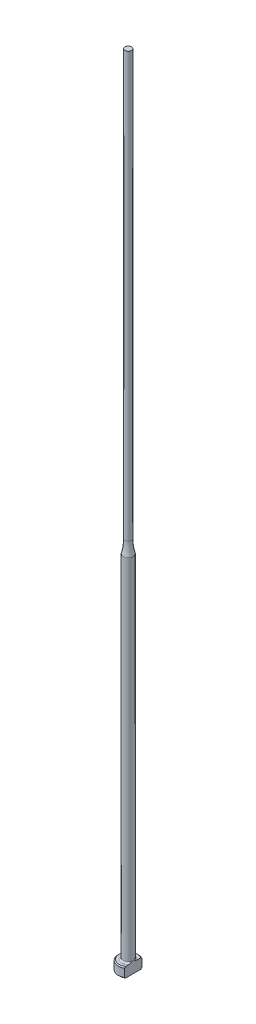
ISO-10303-21;
HEADER;
FILE_DESCRIPTION(('STEP AP214'),'2;1');
FILE_NAME('part.step','',(''),(''),'','','');
FILE_SCHEMA(('AUTOMOTIVE_DESIGN { 1 0 10303 214 1 1 1 1 }'));
ENDSEC;
DATA;
#1=APPLICATION_CONTEXT('core data for automotive mechanical design processes');
#2=APPLICATION_PROTOCOL_DEFINITION('international standard','automotive_design',2000,#1);
#3=PRODUCT_CONTEXT('',#1,'mechanical');
#4=PRODUCT('Part','Part','',(#3));
#5=PRODUCT_RELATED_PRODUCT_CATEGORY('part','',(#4));
#6=PRODUCT_DEFINITION_FORMATION('','',#4);
#7=PRODUCT_DEFINITION_CONTEXT('part definition',#1,'design');
#8=PRODUCT_DEFINITION('design','',#6,#7);
#9=PRODUCT_DEFINITION_SHAPE('','',#8);
#10=(LENGTH_UNIT() NAMED_UNIT(*) SI_UNIT(.MILLI.,.METRE.));
#11=(NAMED_UNIT(*) PLANE_ANGLE_UNIT() SI_UNIT($,.RADIAN.));
#12=(NAMED_UNIT(*) SI_UNIT($,.STERADIAN.) SOLID_ANGLE_UNIT());
#13=UNCERTAINTY_MEASURE_WITH_UNIT(LENGTH_MEASURE(1.E-05),#10,'distance_accuracy_value','');
#14=(GEOMETRIC_REPRESENTATION_CONTEXT(3) GLOBAL_UNCERTAINTY_ASSIGNED_CONTEXT((#13)) GLOBAL_UNIT_ASSIGNED_CONTEXT((#10,
#11,#12)) REPRESENTATION_CONTEXT('',''));
#15=CARTESIAN_POINT('',(0.,0.,0.));
#16=DIRECTION('',(0.,0.,1.));
#17=DIRECTION('',(1.,0.,0.));
#18=AXIS2_PLACEMENT_3D('',#15,#16,#17);
#19=CARTESIAN_POINT('',(-1.99999999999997,2.,0.));
#20=DIRECTION('',(0.,1.,0.));
#21=DIRECTION('',(0.,0.,1.));
#22=AXIS2_PLACEMENT_3D('',#19,#20,#21);
#23=PLANE('',#22);
#24=CARTESIAN_POINT('',(0.,2.,0.));
#25=DIRECTION('',(0.,1.,0.));
#26=DIRECTION('',(0.,0.,1.));
#27=AXIS2_PLACEMENT_3D('',#24,#25,#26);
#28=CIRCLE('',#27,1.79999999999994);
#29=CARTESIAN_POINT('',(0.999999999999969,2.,-1.49666295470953));
#30=VERTEX_POINT('',#29);
#31=CARTESIAN_POINT('',(0.999999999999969,2.,1.49666295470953));
#32=VERTEX_POINT('',#31);
#33=EDGE_CURVE('E187',#30,#32,#28,.T.);
#34=ORIENTED_EDGE('',*,*,#33,.T.);
#35=DIRECTION('',(0.,0.,-1.));
#36=VECTOR('',#35,1.);
#37=CARTESIAN_POINT('',(0.999999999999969,2.,0.));
#38=LINE('',#37,#36);
#39=CARTESIAN_POINT('',(0.999999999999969,2.00000000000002,0.830662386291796));
#40=VERTEX_POINT('',#39);
#41=EDGE_CURVE('E57',#32,#40,#38,.T.);
#42=ORIENTED_EDGE('',*,*,#41,.T.);
#43=CARTESIAN_POINT('',(0.,2.,0.));
#44=DIRECTION('',(0.,1.,0.));
#45=DIRECTION('',(0.,0.,1.));
#46=AXIS2_PLACEMENT_3D('',#43,#44,#45);
#47=CIRCLE('',#46,1.29999999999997);
#48=CARTESIAN_POINT('',(0.999999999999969,2.00000000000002,-0.830662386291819));
#49=VERTEX_POINT('',#48);
#50=EDGE_CURVE('E108',#40,#49,#47,.F.);
#51=ORIENTED_EDGE('',*,*,#50,.T.);
#52=EDGE_CURVE('E137',#49,#30,#38,.T.);
#53=ORIENTED_EDGE('',*,*,#52,.T.);
#54=EDGE_LOOP('',(#34,#42,#51,#53));
#55=FACE_BOUND('',#54,.T.);
#56=ADVANCED_FACE('F32',(#55),#23,.T.);
#57=CARTESIAN_POINT('',(0.,259.958771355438,0.));
#58=DIRECTION('',(0.,1.,0.));
#59=DIRECTION('',(0.,0.,1.));
#60=AXIS2_PLACEMENT_3D('',#57,#58,#59);
#61=CYLINDRICAL_SURFACE('',#60,1.99999999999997);
#62=CARTESIAN_POINT('',(0.,1.79999999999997,0.));
#63=DIRECTION('',(0.,1.,0.));
#64=DIRECTION('',(0.,0.,1.));
#65=AXIS2_PLACEMENT_3D('',#62,#63,#64);
#66=CIRCLE('',#65,1.99999999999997);
#67=CARTESIAN_POINT('',(0.999999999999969,1.79999999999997,1.73205080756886));
#68=VERTEX_POINT('',#67);
#69=CARTESIAN_POINT('',(0.999999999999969,1.79999999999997,-1.73205080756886));
#70=VERTEX_POINT('',#69);
#71=EDGE_CURVE('E105',#68,#70,#66,.F.);
#72=ORIENTED_EDGE('',*,*,#71,.T.);
#73=DIRECTION('',(0.,-1.,0.));
#74=VECTOR('',#73,1.);
#75=CARTESIAN_POINT('',(0.999999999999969,160.,-1.73205080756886));
#76=LINE('',#75,#74);
#77=CARTESIAN_POINT('',(0.999999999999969,0.199999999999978,-1.73205080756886));
#78=VERTEX_POINT('',#77);
#79=EDGE_CURVE('E193',#70,#78,#76,.T.);
#80=ORIENTED_EDGE('',*,*,#79,.T.);
#81=CARTESIAN_POINT('',(0.,0.199999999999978,0.));
#82=DIRECTION('',(0.,-1.,0.));
#83=DIRECTION('',(0.,0.,-1.));
#84=AXIS2_PLACEMENT_3D('',#81,#82,#83);
#85=CIRCLE('',#84,1.99999999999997);
#86=CARTESIAN_POINT('',(0.999999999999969,0.199999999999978,1.73205080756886));
#87=VERTEX_POINT('',#86);
#88=EDGE_CURVE('E100',#78,#87,#85,.F.);
#89=ORIENTED_EDGE('',*,*,#88,.T.);
#90=DIRECTION('',(0.,-1.,0.));
#91=VECTOR('',#90,1.);
#92=CARTESIAN_POINT('',(0.999999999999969,160.,1.73205080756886));
#93=LINE('',#92,#91);
#94=EDGE_CURVE('E93',#68,#87,#93,.T.);
#95=ORIENTED_EDGE('',*,*,#94,.F.);
#96=EDGE_LOOP('',(#72,#80,#89,#95));
#97=FACE_BOUND('',#96,.T.);
#98=ADVANCED_FACE('F158',(#97),#61,.T.);
#99=CARTESIAN_POINT('',(0.,0.,0.));
#100=DIRECTION('',(0.,-1.,0.));
#101=DIRECTION('',(0.,0.,-1.));
#102=AXIS2_PLACEMENT_3D('',#99,#100,#101);
#103=PLANE('',#102);
#104=CARTESIAN_POINT('',(0.,0.,0.));
#105=DIRECTION('',(0.,-1.,0.));
#106=DIRECTION('',(0.,0.,-1.));
#107=AXIS2_PLACEMENT_3D('',#104,#105,#106);
#108=CIRCLE('',#107,1.79999999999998);
#109=CARTESIAN_POINT('',(0.999999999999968,0.,1.49666295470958));
#110=VERTEX_POINT('',#109);
#111=CARTESIAN_POINT('',(0.999999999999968,0.,-1.49666295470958));
#112=VERTEX_POINT('',#111);
#113=EDGE_CURVE('E98',#110,#112,#108,.T.);
#114=ORIENTED_EDGE('',*,*,#113,.T.);
#115=DIRECTION('',(0.,0.,1.));
#116=VECTOR('',#115,1.);
#117=CARTESIAN_POINT('',(0.999999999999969,0.,-1.73205080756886));
#118=LINE('',#117,#116);
#119=EDGE_CURVE('E83',#112,#110,#118,.T.);
#120=ORIENTED_EDGE('',*,*,#119,.T.);
#121=EDGE_LOOP('',(#114,#120));
#122=FACE_BOUND('',#121,.T.);
#123=ADVANCED_FACE('F103',(#122),#103,.T.);
#124=CARTESIAN_POINT('',(0.,2.,0.));
#125=DIRECTION('',(0.,-1.,0.));
#126=DIRECTION('',(0.,0.,-1.));
#127=AXIS2_PLACEMENT_3D('',#124,#125,#126);
#128=CONICAL_SURFACE('',#127,1.79999999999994,0.785398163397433);
#129=ORIENTED_EDGE('',*,*,#71,.F.);
#130=CARTESIAN_POINT('',(0.999999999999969,-0.143084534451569,3.81417299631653));
#131=CARTESIAN_POINT('',(0.999999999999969,-0.0593997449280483,3.72765647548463));
#132=CARTESIAN_POINT('',(0.999999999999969,0.0241940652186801,3.64105173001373));
#133=CARTESIAN_POINT('',(0.999999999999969,0.191148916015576,3.46761616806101));
#134=CARTESIAN_POINT('',(0.999999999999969,0.274509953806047,3.3807853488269));
#135=CARTESIAN_POINT('',(0.999999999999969,0.524249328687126,3.11979400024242));
#136=CARTESIAN_POINT('',(0.999999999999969,0.690198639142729,2.94522254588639));
#137=CARTESIAN_POINT('',(0.999999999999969,1.01697550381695,2.59782670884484));
#138=CARTESIAN_POINT('',(0.999999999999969,1.17783928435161,2.42503661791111));
#139=CARTESIAN_POINT('',(0.999999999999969,1.41669118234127,2.16364984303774));
#140=CARTESIAN_POINT('',(0.999999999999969,1.49589273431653,2.07616357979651));
#141=CARTESIAN_POINT('',(0.999999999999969,1.65313803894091,1.90015721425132));
#142=CARTESIAN_POINT('',(0.999999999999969,1.73118183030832,1.81163714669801));
#143=CARTESIAN_POINT('',(0.999999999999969,1.85567318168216,1.66767927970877));
#144=CARTESIAN_POINT('',(0.999999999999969,1.90265415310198,1.61270332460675));
#145=CARTESIAN_POINT('',(0.999999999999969,1.99577882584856,1.50203557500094));
#146=CARTESIAN_POINT('',(0.999999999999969,2.04192244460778,1.44634371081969));
#147=CARTESIAN_POINT('',(0.999999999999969,2.13356596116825,1.33345480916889));
#148=CARTESIAN_POINT('',(0.999999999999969,2.17905399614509,1.2762481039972));
#149=CARTESIAN_POINT('',(0.999999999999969,2.26844283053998,1.16060976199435));
#150=CARTESIAN_POINT('',(0.999999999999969,2.3123437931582,1.10217825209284));
#151=CARTESIAN_POINT('',(0.999999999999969,2.39853453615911,0.982773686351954));
#152=CARTESIAN_POINT('',(0.999999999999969,2.44078986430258,0.921775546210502));
#153=CARTESIAN_POINT('',(0.999999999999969,2.52187810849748,0.797387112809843));
#154=CARTESIAN_POINT('',(0.999999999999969,2.56070631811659,0.733993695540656));
#155=CARTESIAN_POINT('',(0.999999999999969,2.6324859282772,0.604932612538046));
#156=CARTESIAN_POINT('',(0.999999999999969,2.66550424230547,0.539302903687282));
#157=CARTESIAN_POINT('',(0.999999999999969,2.72301550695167,0.404437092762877));
#158=CARTESIAN_POINT('',(0.999999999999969,2.74753707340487,0.335214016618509));
#159=CARTESIAN_POINT('',(0.999999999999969,2.77407110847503,0.231400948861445));
#160=CARTESIAN_POINT('',(0.999999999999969,2.78110742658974,0.198093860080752));
#161=CARTESIAN_POINT('',(0.999999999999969,2.79200506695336,0.130954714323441));
#162=CARTESIAN_POINT('',(0.999999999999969,2.7958666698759,0.0971227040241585));
#163=CARTESIAN_POINT('',(0.999999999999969,2.80013905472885,0.0293410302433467));
#164=CARTESIAN_POINT('',(0.999999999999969,2.80056046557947,-0.00460794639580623));
#165=CARTESIAN_POINT('',(0.999999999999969,2.79795882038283,-0.0723663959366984));
#166=CARTESIAN_POINT('',(0.999999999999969,2.79493547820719,-0.106175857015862));
#167=CARTESIAN_POINT('',(0.999999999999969,2.78105481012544,-0.206326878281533));
#168=CARTESIAN_POINT('',(0.999999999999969,2.76542146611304,-0.272037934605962));
#169=CARTESIAN_POINT('',(0.999999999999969,2.73477554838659,-0.368312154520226));
#170=CARTESIAN_POINT('',(0.999999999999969,2.72331063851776,-0.40012349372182));
#171=CARTESIAN_POINT('',(0.999999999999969,2.69840546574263,-0.46296441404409));
#172=CARTESIAN_POINT('',(0.999999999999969,2.68496560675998,-0.493994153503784));
#173=CARTESIAN_POINT('',(0.999999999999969,2.64209309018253,-0.586298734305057));
#174=CARTESIAN_POINT('',(0.999999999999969,2.61022871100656,-0.64643570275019));
#175=CARTESIAN_POINT('',(0.999999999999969,2.5422853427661,-0.764304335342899));
#176=CARTESIAN_POINT('',(0.999999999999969,2.50620119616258,-0.822032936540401));
#177=CARTESIAN_POINT('',(0.999999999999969,2.43107084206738,-0.935840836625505));
#178=CARTESIAN_POINT('',(0.999999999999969,2.39201347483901,-0.991912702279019));
#179=CARTESIAN_POINT('',(0.999999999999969,2.31195870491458,-1.10259849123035));
#180=CARTESIAN_POINT('',(0.999999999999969,2.27096226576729,-1.15721311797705));
#181=CARTESIAN_POINT('',(0.999999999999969,2.18701695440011,-1.26606869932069));
#182=CARTESIAN_POINT('',(0.999999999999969,2.14404946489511,-1.32029522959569));
#183=CARTESIAN_POINT('',(0.999999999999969,2.0570505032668,-1.4278898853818));
#184=CARTESIAN_POINT('',(0.999999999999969,2.01301896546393,-1.48125795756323));
#185=CARTESIAN_POINT('',(0.999999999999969,1.87995068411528,-1.64010952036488));
#186=CARTESIAN_POINT('',(0.999999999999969,1.78973357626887,-1.74460261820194));
#187=CARTESIAN_POINT('',(0.999999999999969,1.62290341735,-1.93426834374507));
#188=CARTESIAN_POINT('',(0.999999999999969,1.54658658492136,-2.01970404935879));
#189=CARTESIAN_POINT('',(0.999999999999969,1.39301250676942,-2.18973019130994));
#190=CARTESIAN_POINT('',(0.999999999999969,1.31575523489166,-2.27432060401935));
#191=CARTESIAN_POINT('',(0.999999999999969,1.08283440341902,-2.52732479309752));
#192=CARTESIAN_POINT('',(0.999999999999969,0.926165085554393,-2.69481086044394));
#193=CARTESIAN_POINT('',(0.999999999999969,0.617772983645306,-3.02147252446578));
#194=CARTESIAN_POINT('',(0.999999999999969,0.466111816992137,-3.18070657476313));
#195=CARTESIAN_POINT('',(0.999999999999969,0.238015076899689,-3.41880818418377));
#196=CARTESIAN_POINT('',(0.999999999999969,0.1619245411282,-3.49800657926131));
#197=CARTESIAN_POINT('',(0.999999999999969,0.00955322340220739,-3.65621892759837));
#198=CARTESIAN_POINT('',(0.999999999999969,-0.0667275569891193,-3.73523288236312));
#199=CARTESIAN_POINT('',(0.999999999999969,-0.14308453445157,-3.81417299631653));
#200=B_SPLINE_CURVE_WITH_KNOTS('',3,(#130,#131,#132,#133,#134,#135,#136,#137,#138,#139,#140,
#141,#142,#143,#144,#145,#146,#147,#148,#149,#150,#151,#152,#153,#154,#155,#156,#157,#158,#159,
#160,#161,#162,#163,#164,#165,#166,#167,#168,#169,#170,#171,#172,#173,#174,#175,#176,#177,#178,
#179,#180,#181,#182,#183,#184,#185,#186,#187,#188,#189,#190,#191,#192,#193,#194,#195,#196,#197,
#198,#199),.UNSPECIFIED.,.F.,.F.,(4,2,2,2,2,2,2,2,2,2,2,2,2,2,2,2,2,2,2,2,2,2,2,2,2,2,2,2,2,2,2,
2,2,2,4),(0.,0.36110162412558,0.722207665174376,1.44478731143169,2.15299784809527,
2.5070263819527,2.8610430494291,3.07798416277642,3.29494655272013,3.51418925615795,
3.73340935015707,3.95594813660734,4.17878792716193,4.39886399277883,4.61819150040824,
4.72018864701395,4.82217677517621,4.92384967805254,5.02553102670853,5.22698459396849,
5.32838854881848,5.4297717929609,5.63365200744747,5.837784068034,6.04272417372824,
6.24756349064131,6.45510395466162,6.66265726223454,7.07676259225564,7.42043039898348,
7.76410778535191,8.45210822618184,9.11180822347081,9.44129145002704,9.77077197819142),.UNSPECIFIED.);
#201=EDGE_CURVE('E136',#68,#32,#200,.T.);
#202=ORIENTED_EDGE('',*,*,#201,.T.);
#203=ORIENTED_EDGE('',*,*,#33,.F.);
#204=EDGE_CURVE('E128',#30,#70,#200,.T.);
#205=ORIENTED_EDGE('',*,*,#204,.T.);
#206=EDGE_LOOP('',(#129,#202,#203,#205));
#207=FACE_BOUND('',#206,.T.);
#208=ADVANCED_FACE('F144',(#207),#128,.T.);
#209=CARTESIAN_POINT('',(0.,0.199999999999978,0.));
#210=DIRECTION('',(0.,1.,0.));
#211=DIRECTION('',(0.,0.,1.));
#212=AXIS2_PLACEMENT_3D('',#209,#210,#211);
#213=CONICAL_SURFACE('',#212,1.99999999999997,0.785398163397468);
#214=ORIENTED_EDGE('',*,*,#88,.F.);
#215=CARTESIAN_POINT('',(0.999999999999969,2.14308453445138,-3.81417299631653));
#216=CARTESIAN_POINT('',(0.999999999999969,2.05939974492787,-3.72765647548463));
#217=CARTESIAN_POINT('',(0.999999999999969,1.97580593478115,-3.64105173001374));
#218=CARTESIAN_POINT('',(0.999999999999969,1.80885108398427,-3.46761616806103));
#219=CARTESIAN_POINT('',(0.999999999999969,1.72549004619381,-3.38078534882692));
#220=CARTESIAN_POINT('',(0.999999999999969,1.47575067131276,-3.11979400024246));
#221=CARTESIAN_POINT('',(0.999999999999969,1.30980136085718,-2.94522254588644));
#222=CARTESIAN_POINT('',(0.999999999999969,0.983024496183,-2.5978267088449));
#223=CARTESIAN_POINT('',(0.999999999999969,0.822160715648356,-2.42503661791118));
#224=CARTESIAN_POINT('',(0.999999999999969,0.583308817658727,-2.16364984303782));
#225=CARTESIAN_POINT('',(0.999999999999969,0.50410726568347,-2.0761635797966));
#226=CARTESIAN_POINT('',(0.999999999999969,0.346861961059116,-1.90015721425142));
#227=CARTESIAN_POINT('',(0.999999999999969,0.26881816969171,-1.81163714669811));
#228=CARTESIAN_POINT('',(0.999999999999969,0.144326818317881,-1.66767927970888));
#229=CARTESIAN_POINT('',(0.999999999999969,0.0973458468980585,-1.61270332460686));
#230=CARTESIAN_POINT('',(0.999999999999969,0.00422117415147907,-1.50203557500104));
#231=CARTESIAN_POINT('',(0.999999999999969,-0.0419224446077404,-1.44634371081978));
#232=CARTESIAN_POINT('',(0.999999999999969,-0.133565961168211,-1.33345480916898));
#233=CARTESIAN_POINT('',(0.999999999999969,-0.179053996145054,-1.27624810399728));
#234=CARTESIAN_POINT('',(0.999999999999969,-0.268442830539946,-1.16060976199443));
#235=CARTESIAN_POINT('',(0.999999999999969,-0.31234379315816,-1.10217825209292));
#236=CARTESIAN_POINT('',(0.999999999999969,-0.398534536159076,-0.982773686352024));
#237=CARTESIAN_POINT('',(0.999999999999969,-0.440789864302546,-0.92177554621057));
#238=CARTESIAN_POINT('',(0.999999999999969,-0.521878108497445,-0.797387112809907));
#239=CARTESIAN_POINT('',(0.999999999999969,-0.560706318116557,-0.733993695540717));
#240=CARTESIAN_POINT('',(0.999999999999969,-0.632485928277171,-0.604932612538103));
#241=CARTESIAN_POINT('',(0.999999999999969,-0.665504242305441,-0.539302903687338));
#242=CARTESIAN_POINT('',(0.999999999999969,-0.723015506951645,-0.404437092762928));
#243=CARTESIAN_POINT('',(0.999999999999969,-0.747537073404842,-0.335214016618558));
#244=CARTESIAN_POINT('',(0.999999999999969,-0.774071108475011,-0.231400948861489));
#245=CARTESIAN_POINT('',(0.999999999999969,-0.781107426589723,-0.198093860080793));
#246=CARTESIAN_POINT('',(0.999999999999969,-0.792005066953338,-0.130954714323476));
#247=CARTESIAN_POINT('',(0.999999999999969,-0.795866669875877,-0.0971227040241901));
#248=CARTESIAN_POINT('',(0.999999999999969,-0.800139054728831,-0.0293410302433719));
#249=CARTESIAN_POINT('',(0.999999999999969,-0.80056046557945,0.00460794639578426));
#250=CARTESIAN_POINT('',(0.999999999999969,-0.797958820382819,0.0723663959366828));
#251=CARTESIAN_POINT('',(0.999999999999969,-0.794935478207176,0.106175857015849));
#252=CARTESIAN_POINT('',(0.999999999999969,-0.781054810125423,0.20632687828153));
#253=CARTESIAN_POINT('',(0.999999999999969,-0.765421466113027,0.272037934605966));
#254=CARTESIAN_POINT('',(0.999999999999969,-0.734775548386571,0.36831215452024));
#255=CARTESIAN_POINT('',(0.999999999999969,-0.723310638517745,0.400123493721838));
#256=CARTESIAN_POINT('',(0.999999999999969,-0.698405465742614,0.462964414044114));
#257=CARTESIAN_POINT('',(0.999999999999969,-0.684965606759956,0.493994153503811));
#258=CARTESIAN_POINT('',(0.999999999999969,-0.642093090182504,0.586298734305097));
#259=CARTESIAN_POINT('',(0.999999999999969,-0.610228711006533,0.646435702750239));
#260=CARTESIAN_POINT('',(0.999999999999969,-0.542285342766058,0.764304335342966));
#261=CARTESIAN_POINT('',(0.999999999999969,-0.506201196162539,0.822032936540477));
#262=CARTESIAN_POINT('',(0.999999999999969,-0.431070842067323,0.935840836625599));
#263=CARTESIAN_POINT('',(0.999999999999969,-0.392013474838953,0.991912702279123));
#264=CARTESIAN_POINT('',(0.999999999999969,-0.311958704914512,1.10259849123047));
#265=CARTESIAN_POINT('',(0.999999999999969,-0.270962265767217,1.15721311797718));
#266=CARTESIAN_POINT('',(0.999999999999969,-0.187016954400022,1.26606869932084));
#267=CARTESIAN_POINT('',(0.999999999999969,-0.144049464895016,1.32029522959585));
#268=CARTESIAN_POINT('',(0.999999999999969,-0.0570505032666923,1.42788988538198));
#269=CARTESIAN_POINT('',(0.999999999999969,-0.0130189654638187,1.48125795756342));
#270=CARTESIAN_POINT('',(0.999999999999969,0.120049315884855,1.64010952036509));
#271=CARTESIAN_POINT('',(0.999999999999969,0.21026642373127,1.74460261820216));
#272=CARTESIAN_POINT('',(0.999999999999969,0.37709658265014,1.9342683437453));
#273=CARTESIAN_POINT('',(0.999999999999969,0.453413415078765,2.01970404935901));
#274=CARTESIAN_POINT('',(0.999999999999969,0.606987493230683,2.18973019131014));
#275=CARTESIAN_POINT('',(0.999999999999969,0.684244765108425,2.27432060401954));
#276=CARTESIAN_POINT('',(0.999999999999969,0.917165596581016,2.52732479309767));
#277=CARTESIAN_POINT('',(0.999999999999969,1.07383491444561,2.69481086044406));
#278=CARTESIAN_POINT('',(0.999999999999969,1.38222701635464,3.02147252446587));
#279=CARTESIAN_POINT('',(0.999999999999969,1.53388818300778,3.1807065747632));
#280=CARTESIAN_POINT('',(0.999999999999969,1.76198492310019,3.41880818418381));
#281=CARTESIAN_POINT('',(0.999999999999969,1.83807545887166,3.49800657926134));
#282=CARTESIAN_POINT('',(0.999999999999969,1.99044677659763,3.65621892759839));
#283=CARTESIAN_POINT('',(0.999999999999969,2.06672755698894,3.73523288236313));
#284=CARTESIAN_POINT('',(0.999999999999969,2.14308453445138,3.81417299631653));
#285=B_SPLINE_CURVE_WITH_KNOTS('',3,(#215,#216,#217,#218,#219,#220,#221,#222,#223,#224,#225,
#226,#227,#228,#229,#230,#231,#232,#233,#234,#235,#236,#237,#238,#239,#240,#241,#242,#243,#244,
#245,#246,#247,#248,#249,#250,#251,#252,#253,#254,#255,#256,#257,#258,#259,#260,#261,#262,#263,
#264,#265,#266,#267,#268,#269,#270,#271,#272,#273,#274,#275,#276,#277,#278,#279,#280,#281,#282,
#283,#284),.UNSPECIFIED.,.F.,.F.,(4,2,2,2,2,2,2,2,2,2,2,2,2,2,2,2,2,2,2,2,2,2,2,2,2,2,2,2,2,2,2,
2,2,2,4),(0.,0.36110162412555,0.722207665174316,1.44478731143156,2.15299784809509,
2.5070263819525,2.86104304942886,3.07798416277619,3.2949465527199,3.51418925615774,
3.73340935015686,3.95594813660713,4.17878792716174,4.39886399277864,4.61819150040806,
4.72018864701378,4.82217677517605,4.92384967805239,5.02553102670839,5.22698459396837,
5.32838854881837,5.4297717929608,5.6336520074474,5.83778406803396,6.04272417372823,
6.24756349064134,6.45510395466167,6.66265726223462,7.07676259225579,7.42043039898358,
7.76410778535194,8.45210822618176,9.11180822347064,9.44129145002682,9.77077197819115),.UNSPECIFIED.);
#286=EDGE_CURVE('E86',#78,#112,#285,.T.);
#287=ORIENTED_EDGE('',*,*,#286,.T.);
#288=ORIENTED_EDGE('',*,*,#113,.F.);
#289=EDGE_CURVE('E89',#110,#87,#285,.T.);
#290=ORIENTED_EDGE('',*,*,#289,.T.);
#291=EDGE_LOOP('',(#214,#287,#288,#290));
#292=FACE_BOUND('',#291,.T.);
#293=ADVANCED_FACE('F97',(#292),#213,.T.);
#294=CARTESIAN_POINT('',(0.,2.30000000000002,0.));
#295=DIRECTION('',(0.,1.,0.));
#296=DIRECTION('',(0.,0.,1.));
#297=AXIS2_PLACEMENT_3D('',#294,#295,#296);
#298=TOROIDAL_SURFACE('',#297,1.29999999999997,0.3);
#299=CARTESIAN_POINT('',(0.999999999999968,2.30000000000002,0.));
#300=CARTESIAN_POINT('',(0.999999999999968,2.30000064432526,8.6574445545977E-12));
#301=CARTESIAN_POINT('',(0.999999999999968,2.30000128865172,-9.05742231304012E-08));
#302=CARTESIAN_POINT('',(0.999999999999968,2.30000254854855,-3.98319620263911E-07));
#303=CARTESIAN_POINT('',(0.999999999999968,2.30000316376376,-6.16748313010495E-07));
#304=CARTESIAN_POINT('',(0.999999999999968,2.30000438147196,-1.15047367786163E-06));
#305=CARTESIAN_POINT('',(0.999999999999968,2.30000498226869,-1.46954564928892E-06));
#306=CARTESIAN_POINT('',(0.999999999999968,2.30000613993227,-2.17388585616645E-06));
#307=CARTESIAN_POINT('',(0.999999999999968,2.3000066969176,-2.55896592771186E-06));
#308=CARTESIAN_POINT('',(0.999999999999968,2.30000847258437,-3.89137454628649E-06));
#309=CARTESIAN_POINT('',(0.999999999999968,2.30000962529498,-4.9272569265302E-06));
#310=CARTESIAN_POINT('',(0.999999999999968,2.30001175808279,-7.12255376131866E-06));
#311=CARTESIAN_POINT('',(0.999999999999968,2.30001274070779,-8.27963246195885E-06));
#312=CARTESIAN_POINT('',(0.999999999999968,2.30001619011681,-1.25710396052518E-05));
#313=CARTESIAN_POINT('',(0.999999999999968,2.30001847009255,-1.58589994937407E-05));
#314=CARTESIAN_POINT('',(0.999999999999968,2.3000224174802,-2.25210462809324E-05));
#315=CARTESIAN_POINT('',(0.999999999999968,2.30002411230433,-2.58796667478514E-05));
#316=CARTESIAN_POINT('',(0.999999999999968,2.30003085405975,-3.94941957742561E-05));
#317=CARTESIAN_POINT('',(0.999999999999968,2.30003568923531,-4.98493079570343E-05));
#318=CARTESIAN_POINT('',(0.999999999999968,2.30004388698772,-6.96407730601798E-05));
#319=CARTESIAN_POINT('',(0.999999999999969,2.30004735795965,-7.903098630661E-05));
#320=CARTESIAN_POINT('',(0.999999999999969,2.30007348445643,-0.000144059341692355));
#321=CARTESIAN_POINT('',(0.999999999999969,2.30010510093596,-0.000195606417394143));
#322=CARTESIAN_POINT('',(0.999999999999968,2.30022061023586,-0.000391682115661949));
#323=CARTESIAN_POINT('',(0.999999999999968,2.3002978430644,-0.000539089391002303));
#324=CARTESIAN_POINT('',(0.999999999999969,2.30059433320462,-0.00109591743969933));
#325=CARTESIAN_POINT('',(0.999999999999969,2.30082052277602,-0.00150237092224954));
#326=CARTESIAN_POINT('',(0.999999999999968,2.30171558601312,-0.00311941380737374));
#327=CARTESIAN_POINT('',(0.999999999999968,2.30237677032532,-0.00433326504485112));
#328=CARTESIAN_POINT('',(0.999999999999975,2.31602135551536,-0.0293725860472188));
#329=CARTESIAN_POINT('',(0.99999999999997,2.32909104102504,-0.0531623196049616));
#330=CARTESIAN_POINT('',(0.999999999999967,2.35458080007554,-0.100088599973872));
#331=CARTESIAN_POINT('',(0.999999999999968,2.36700820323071,-0.123221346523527));
#332=CARTESIAN_POINT('',(0.999999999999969,2.39281545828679,-0.172044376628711));
#333=CARTESIAN_POINT('',(0.999999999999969,2.4061616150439,-0.197752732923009));
#334=CARTESIAN_POINT('',(0.999999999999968,2.4323541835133,-0.249714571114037));
#335=CARTESIAN_POINT('',(0.999999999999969,2.44519503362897,-0.27597087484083));
#336=CARTESIAN_POINT('',(0.999999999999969,2.46718175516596,-0.322864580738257));
#337=CARTESIAN_POINT('',(0.999999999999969,2.47650292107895,-0.34341923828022));
#338=CARTESIAN_POINT('',(0.999999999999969,2.49448113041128,-0.384761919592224));
#339=CARTESIAN_POINT('',(0.999999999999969,2.50313958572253,-0.405549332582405));
#340=CARTESIAN_POINT('',(0.999999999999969,2.5276434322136,-0.467585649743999));
#341=CARTESIAN_POINT('',(0.999999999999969,2.54239224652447,-0.509286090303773));
#342=CARTESIAN_POINT('',(0.999999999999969,2.56458900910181,-0.58349816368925));
#343=CARTESIAN_POINT('',(0.999999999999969,2.57294045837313,-0.61573699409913));
#344=CARTESIAN_POINT('',(0.999999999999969,2.58691787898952,-0.682155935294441));
#345=CARTESIAN_POINT('',(0.999999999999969,2.5924232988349,-0.716362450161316));
#346=CARTESIAN_POINT('',(0.999999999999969,2.59932200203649,-0.784996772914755));
#347=CARTESIAN_POINT('',(0.999999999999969,2.60074119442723,-0.819421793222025));
#348=CARTESIAN_POINT('',(0.999999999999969,2.59853032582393,-0.88779225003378));
#349=CARTESIAN_POINT('',(0.999999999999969,2.59495737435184,-0.921738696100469));
#350=CARTESIAN_POINT('',(0.999999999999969,2.58381038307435,-0.977927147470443));
#351=CARTESIAN_POINT('',(0.999999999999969,2.57785171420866,-1.00048693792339));
#352=CARTESIAN_POINT('',(0.999999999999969,2.56267132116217,-1.0445512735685));
#353=CARTESIAN_POINT('',(0.999999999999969,2.55344592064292,-1.06605459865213));
#354=CARTESIAN_POINT('',(0.999999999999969,2.53348156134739,-1.10327564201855));
#355=CARTESIAN_POINT('',(0.999999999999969,2.52335553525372,-1.11931996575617));
#356=CARTESIAN_POINT('',(0.999999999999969,2.50063930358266,-1.1495565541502));
#357=CARTESIAN_POINT('',(0.999999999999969,2.48805327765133,-1.16375189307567));
#358=CARTESIAN_POINT('',(0.999999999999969,2.46313284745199,-1.18709127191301));
#359=CARTESIAN_POINT('',(0.999999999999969,2.45121755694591,-1.19668155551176));
#360=CARTESIAN_POINT('',(0.999999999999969,2.4259612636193,-1.21377371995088));
#361=CARTESIAN_POINT('',(0.999999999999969,2.41262072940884,-1.2212762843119));
#362=CARTESIAN_POINT('',(0.999999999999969,2.38471163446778,-1.23381879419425));
#363=CARTESIAN_POINT('',(0.999999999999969,2.3701356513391,-1.23884240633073));
#364=CARTESIAN_POINT('',(0.999999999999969,2.34029120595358,-1.2460136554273));
#365=CARTESIAN_POINT('',(0.999999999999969,2.32502317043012,-1.24816304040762));
#366=CARTESIAN_POINT('',(0.999999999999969,2.29609418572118,-1.24936303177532));
#367=CARTESIAN_POINT('',(0.999999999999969,2.28244572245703,-1.24873511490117));
#368=CARTESIAN_POINT('',(0.999999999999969,2.25546467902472,-1.24513625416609));
#369=CARTESIAN_POINT('',(0.999999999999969,2.2421320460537,-1.24216570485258));
#370=CARTESIAN_POINT('',(0.999999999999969,2.21644742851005,-1.23414136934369));
#371=CARTESIAN_POINT('',(0.999999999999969,2.20408009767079,-1.22913614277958));
#372=CARTESIAN_POINT('',(0.999999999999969,2.18026539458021,-1.2172891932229));
#373=CARTESIAN_POINT('',(0.999999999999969,2.16881815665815,-1.21044720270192));
#374=CARTESIAN_POINT('',(0.999999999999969,2.14602713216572,-1.19450929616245));
#375=CARTESIAN_POINT('',(0.999999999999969,2.1347876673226,-1.18526487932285));
#376=CARTESIAN_POINT('',(0.999999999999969,2.11372805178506,-1.16528066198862));
#377=CARTESIAN_POINT('',(0.999999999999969,2.1039092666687,-1.15453944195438));
#378=CARTESIAN_POINT('',(0.999999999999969,2.08131380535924,-1.12639326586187));
#379=CARTESIAN_POINT('',(0.999999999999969,2.06941227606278,-1.10828305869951));
#380=CARTESIAN_POINT('',(0.999999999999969,2.04871157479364,-1.07041295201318));
#381=CARTESIAN_POINT('',(0.999999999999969,2.03991325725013,-1.05065259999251));
#382=CARTESIAN_POINT('',(0.999999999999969,2.02219264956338,-1.00203188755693));
#383=CARTESIAN_POINT('',(0.999999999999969,2.01461756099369,-0.972682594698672));
#384=CARTESIAN_POINT('',(0.999999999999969,2.00410660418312,-0.912914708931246));
#385=CARTESIAN_POINT('',(0.999999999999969,2.00122174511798,-0.882487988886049));
#386=CARTESIAN_POINT('',(0.999999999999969,1.99886242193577,-0.80318909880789));
#387=CARTESIAN_POINT('',(0.999999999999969,2.0024814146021,-0.754226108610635));
#388=CARTESIAN_POINT('',(0.999999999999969,2.01327071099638,-0.682724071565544));
#389=CARTESIAN_POINT('',(0.999999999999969,2.01762186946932,-0.659663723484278));
#390=CARTESIAN_POINT('',(0.999999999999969,2.02775671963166,-0.613959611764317));
#391=CARTESIAN_POINT('',(0.999999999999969,2.03353398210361,-0.59131445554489));
#392=CARTESIAN_POINT('',(0.999999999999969,2.05232003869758,-0.525222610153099));
#393=CARTESIAN_POINT('',(0.999999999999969,2.0670175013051,-0.482256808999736));
#394=CARTESIAN_POINT('',(0.999999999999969,2.09166172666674,-0.418361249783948));
#395=CARTESIAN_POINT('',(0.999999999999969,2.10040936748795,-0.396945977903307));
#396=CARTESIAN_POINT('',(0.999999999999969,2.11862724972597,-0.354367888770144));
#397=CARTESIAN_POINT('',(0.999999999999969,2.12809902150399,-0.33320572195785));
#398=CARTESIAN_POINT('',(0.999999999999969,2.15054796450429,-0.284809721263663));
#399=CARTESIAN_POINT('',(0.999999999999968,2.16372144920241,-0.257667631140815));
#400=CARTESIAN_POINT('',(0.999999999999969,2.19063957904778,-0.203972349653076));
#401=CARTESIAN_POINT('',(0.999999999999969,2.20437810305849,-0.177416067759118));
#402=CARTESIAN_POINT('',(0.999999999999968,2.23096755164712,-0.127000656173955));
#403=CARTESIAN_POINT('',(0.999999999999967,2.2437812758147,-0.103121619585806));
#404=CARTESIAN_POINT('',(0.99999999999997,2.27007504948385,-0.0546869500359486));
#405=CARTESIAN_POINT('',(0.999999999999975,2.28356304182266,-0.0301354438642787));
#406=CARTESIAN_POINT('',(0.999999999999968,2.29762327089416,-0.00433318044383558));
#407=CARTESIAN_POINT('',(0.999999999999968,2.29828450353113,-0.00311924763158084));
#408=CARTESIAN_POINT('',(0.999999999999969,2.29917957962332,-0.0015021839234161));
#409=CARTESIAN_POINT('',(0.999999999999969,2.2994057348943,-0.0010957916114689));
#410=CARTESIAN_POINT('',(0.999999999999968,2.29970218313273,-0.000539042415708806));
#411=CARTESIAN_POINT('',(0.999999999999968,2.29977940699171,-0.000391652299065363));
#412=CARTESIAN_POINT('',(0.999999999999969,2.29989490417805,-0.000195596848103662));
#413=CARTESIAN_POINT('',(0.999999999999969,2.2999265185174,-0.000144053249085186));
#414=CARTESIAN_POINT('',(0.999999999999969,2.29995264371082,-7.90290824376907E-05));
#415=CARTESIAN_POINT('',(0.999999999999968,2.29995611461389,-6.96391975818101E-05));
#416=CARTESIAN_POINT('',(0.999999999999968,2.29996431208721,-4.98484228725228E-05));
#417=CARTESIAN_POINT('',(0.999999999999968,2.29996914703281,-3.94936645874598E-05));
#418=CARTESIAN_POINT('',(0.999999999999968,2.29997588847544,-2.587953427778E-05));
#419=CARTESIAN_POINT('',(0.999999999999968,2.29997758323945,-2.25209724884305E-05));
#420=CARTESIAN_POINT('',(0.999999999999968,2.29998153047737,-1.58590310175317E-05));
#421=CARTESIAN_POINT('',(0.999999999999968,2.29998381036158,-1.25711163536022E-05));
#422=CARTESIAN_POINT('',(0.999999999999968,2.29998725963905,-8.27974911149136E-06));
#423=CARTESIAN_POINT('',(0.999999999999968,2.29998824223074,-7.122675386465E-06));
#424=CARTESIAN_POINT('',(0.999999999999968,2.29999037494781,-4.92738159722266E-06));
#425=CARTESIAN_POINT('',(0.999999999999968,2.29999152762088,-3.89149712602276E-06));
#426=CARTESIAN_POINT('',(0.999999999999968,2.29999330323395,-2.5590774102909E-06));
#427=CARTESIAN_POINT('',(0.999999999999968,2.29999386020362,-2.17399250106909E-06));
#428=CARTESIAN_POINT('',(0.999999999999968,2.29999501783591,-1.4696398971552E-06));
#429=CARTESIAN_POINT('',(0.999999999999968,2.299995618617,-1.15056035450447E-06));
#430=CARTESIAN_POINT('',(0.999999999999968,2.29999683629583,-6.16816558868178E-07));
#431=CARTESIAN_POINT('',(0.999999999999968,2.29999745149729,-3.98377208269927E-07));
#432=CARTESIAN_POINT('',(0.999999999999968,2.29999871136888,-9.06063088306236E-08));
#433=CARTESIAN_POINT('',(0.999999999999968,2.29999935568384,-8.657323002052E-12));
#434=CARTESIAN_POINT('',(0.999999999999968,2.30000000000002,0.));
#435=B_SPLINE_CURVE_WITH_KNOTS('',3,(#299,#300,#301,#302,#303,#304,#305,#306,#307,#308,#309,
#310,#311,#312,#313,#314,#315,#316,#317,#318,#319,#320,#321,#322,#323,#324,#325,#326,#327,#328,
#329,#330,#331,#332,#333,#334,#335,#336,#337,#338,#339,#340,#341,#342,#343,#344,#345,#346,#347,
#348,#349,#350,#351,#352,#353,#354,#355,#356,#357,#358,#359,#360,#361,#362,#363,#364,#365,#366,
#367,#368,#369,#370,#371,#372,#373,#374,#375,#376,#377,#378,#379,#380,#381,#382,#383,#384,#385,
#386,#387,#388,#389,#390,#391,#392,#393,#394,#395,#396,#397,#398,#399,#400,#401,#402,#403,#404,
#405,#406,#407,#408,#409,#410,#411,#412,#413,#414,#415,#416,#417,#418,#419,#420,#421,#422,#423,
#424,#425,#426,#427,#428,#429,#430,#431,#432,#433,#434),.UNSPECIFIED.,.T.,.F.,(4,2,2,2,2,2,2,2,
2,2,2,2,2,2,2,2,2,2,2,2,2,2,2,2,2,2,2,2,2,2,2,2,2,2,2,2,2,2,2,2,2,2,2,2,2,2,2,2,2,2,2,2,2,2,2,2,
2,2,2,2,2,2,2,2,2,2,2,4),(0.,1.93088000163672E-06,3.88121487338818E-06,5.91576027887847E-06,
7.94459959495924E-06,1.25713540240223E-05,1.71213138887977E-05,2.9075120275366E-05,
4.0350817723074E-05,7.46190414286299E-05,0.000104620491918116,0.00028499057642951,
0.000785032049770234,0.00217951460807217,0.00632720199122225,0.0877445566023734,
0.166524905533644,0.253417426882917,0.341089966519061,0.408787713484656,0.476336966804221,
0.608850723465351,0.708652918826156,0.812393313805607,0.915474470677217,1.01738599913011,
1.08718721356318,1.15706723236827,1.21377727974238,1.27039179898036,1.31609373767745,
1.36178069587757,1.40776478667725,1.4537208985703,1.49450576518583,1.5352837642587,
1.57514089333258,1.61500383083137,1.65849635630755,1.70203041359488,1.76667915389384,
1.83134568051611,1.92177629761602,2.0131839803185,2.15955153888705,2.22993031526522,
2.29999742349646,2.43600819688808,2.50540041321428,2.57494356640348,2.66544006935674,
2.75513178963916,2.83643278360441,2.92045687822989,2.92460484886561,2.92599912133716,
2.926499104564,2.92667946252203,2.92670946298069,2.92674372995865,2.92675500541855,
2.92676695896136,2.92677150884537,2.92677613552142,2.92677816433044,2.92678019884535,
2.92678214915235,2.92678408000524),.UNSPECIFIED.);
#436=CARTESIAN_POINT('',(0.999999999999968,2.30000000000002,0.));
#437=VERTEX_POINT('',#436);
#438=EDGE_CURVE('E11',#49,#437,#435,.T.);
#439=ORIENTED_EDGE('',*,*,#438,.F.);
#440=ORIENTED_EDGE('',*,*,#50,.F.);
#441=CARTESIAN_POINT('',(0.999999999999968,2.30000000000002,0.));
#442=CARTESIAN_POINT('',(0.999999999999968,2.29999935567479,-8.65741696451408E-12));
#443=CARTESIAN_POINT('',(0.999999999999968,2.29999871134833,9.05742231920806E-08));
#444=CARTESIAN_POINT('',(0.999999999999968,2.2999974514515,3.98319620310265E-07));
#445=CARTESIAN_POINT('',(0.999999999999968,2.29999683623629,6.16748313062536E-07));
#446=CARTESIAN_POINT('',(0.999999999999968,2.29999561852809,1.15047367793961E-06));
#447=CARTESIAN_POINT('',(0.999999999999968,2.29999501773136,1.46954564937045E-06));
#448=CARTESIAN_POINT('',(0.999999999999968,2.29999386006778,2.17388585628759E-06));
#449=CARTESIAN_POINT('',(0.999999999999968,2.29999330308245,2.55896592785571E-06));
#450=CARTESIAN_POINT('',(0.999999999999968,2.29999152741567,3.89137454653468E-06));
#451=CARTESIAN_POINT('',(0.999999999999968,2.29999037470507,4.92725692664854E-06));
#452=CARTESIAN_POINT('',(0.999999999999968,2.29998824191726,7.12255376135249E-06));
#453=CARTESIAN_POINT('',(0.999999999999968,2.29998725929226,8.27963246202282E-06));
#454=CARTESIAN_POINT('',(0.999999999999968,2.29998380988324,1.25710396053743E-05));
#455=CARTESIAN_POINT('',(0.999999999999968,2.2999815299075,1.58589994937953E-05));
#456=CARTESIAN_POINT('',(0.999999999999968,2.29997758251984,2.25210462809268E-05));
#457=CARTESIAN_POINT('',(0.999999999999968,2.29997588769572,2.58796667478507E-05));
#458=CARTESIAN_POINT('',(0.999999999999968,2.29996914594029,3.94941957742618E-05));
#459=CARTESIAN_POINT('',(0.999999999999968,2.29996431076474,4.98493079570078E-05));
#460=CARTESIAN_POINT('',(0.999999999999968,2.29995611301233,6.96407730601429E-05));
#461=CARTESIAN_POINT('',(0.999999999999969,2.2999526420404,7.90309863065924E-05));
#462=CARTESIAN_POINT('',(0.999999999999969,2.29992651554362,0.000144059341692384));
#463=CARTESIAN_POINT('',(0.999999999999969,2.29989489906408,0.000195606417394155));
#464=CARTESIAN_POINT('',(0.999999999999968,2.29977938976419,0.000391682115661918));
#465=CARTESIAN_POINT('',(0.999999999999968,2.29970215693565,0.000539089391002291));
#466=CARTESIAN_POINT('',(0.999999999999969,2.29940566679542,0.00109591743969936));
#467=CARTESIAN_POINT('',(0.999999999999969,2.29917947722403,0.00150237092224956));
#468=CARTESIAN_POINT('',(0.999999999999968,2.29828441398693,0.0031194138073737));
#469=CARTESIAN_POINT('',(0.999999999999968,2.29762322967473,0.0043332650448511));
#470=CARTESIAN_POINT('',(0.999999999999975,2.28397864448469,0.0293725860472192));
#471=CARTESIAN_POINT('',(0.99999999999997,2.27090895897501,0.0531623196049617));
#472=CARTESIAN_POINT('',(0.999999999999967,2.24541919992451,0.100088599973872));
#473=CARTESIAN_POINT('',(0.999999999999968,2.23299179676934,0.123221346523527));
#474=CARTESIAN_POINT('',(0.999999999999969,2.20718454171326,0.172044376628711));
#475=CARTESIAN_POINT('',(0.999999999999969,2.19383838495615,0.197752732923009));
#476=CARTESIAN_POINT('',(0.999999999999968,2.16764581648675,0.249714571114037));
#477=CARTESIAN_POINT('',(0.999999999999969,2.15480496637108,0.27597087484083));
#478=CARTESIAN_POINT('',(0.999999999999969,2.13281824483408,0.322864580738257));
#479=CARTESIAN_POINT('',(0.999999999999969,2.1234970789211,0.34341923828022));
#480=CARTESIAN_POINT('',(0.999999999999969,2.10551886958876,0.384761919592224));
#481=CARTESIAN_POINT('',(0.999999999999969,2.09686041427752,0.405549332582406));
#482=CARTESIAN_POINT('',(0.999999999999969,2.07235656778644,0.467585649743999));
#483=CARTESIAN_POINT('',(0.999999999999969,2.05760775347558,0.509286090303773));
#484=CARTESIAN_POINT('',(0.999999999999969,2.03541099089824,0.58349816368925));
#485=CARTESIAN_POINT('',(0.999999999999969,2.02705954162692,0.61573699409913));
#486=CARTESIAN_POINT('',(0.999999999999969,2.01308212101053,0.682155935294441));
#487=CARTESIAN_POINT('',(0.999999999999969,2.00757670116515,0.716362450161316));
#488=CARTESIAN_POINT('',(0.999999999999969,2.00067799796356,0.784996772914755));
#489=CARTESIAN_POINT('',(0.999999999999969,1.99925880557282,0.819421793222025));
#490=CARTESIAN_POINT('',(0.999999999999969,2.00146967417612,0.88779225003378));
#491=CARTESIAN_POINT('',(0.999999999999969,2.00504262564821,0.921738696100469));
#492=CARTESIAN_POINT('',(0.999999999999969,2.0161896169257,0.977927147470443));
#493=CARTESIAN_POINT('',(0.999999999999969,2.02214828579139,1.00048693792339));
#494=CARTESIAN_POINT('',(0.999999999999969,2.03732867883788,1.0445512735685));
#495=CARTESIAN_POINT('',(0.999999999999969,2.04655407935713,1.06605459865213));
#496=CARTESIAN_POINT('',(0.999999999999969,2.06651843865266,1.10327564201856));
#497=CARTESIAN_POINT('',(0.999999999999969,2.07664446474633,1.11931996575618));
#498=CARTESIAN_POINT('',(0.999999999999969,2.09936069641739,1.14955655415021));
#499=CARTESIAN_POINT('',(0.999999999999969,2.11194672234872,1.16375189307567));
#500=CARTESIAN_POINT('',(0.999999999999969,2.13686715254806,1.18709127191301));
#501=CARTESIAN_POINT('',(0.999999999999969,2.14878244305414,1.19668155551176));
#502=CARTESIAN_POINT('',(0.999999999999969,2.17403873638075,1.21377371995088));
#503=CARTESIAN_POINT('',(0.999999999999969,2.18737927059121,1.2212762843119));
#504=CARTESIAN_POINT('',(0.999999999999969,2.21528836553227,1.23381879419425));
#505=CARTESIAN_POINT('',(0.999999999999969,2.22986434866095,1.23884240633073));
#506=CARTESIAN_POINT('',(0.999999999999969,2.25970879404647,1.2460136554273));
#507=CARTESIAN_POINT('',(0.999999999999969,2.27497682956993,1.24816304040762));
#508=CARTESIAN_POINT('',(0.999999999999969,2.30390581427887,1.24936303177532));
#509=CARTESIAN_POINT('',(0.999999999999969,2.31755427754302,1.24873511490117));
#510=CARTESIAN_POINT('',(0.999999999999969,2.34453532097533,1.24513625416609));
#511=CARTESIAN_POINT('',(0.999999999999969,2.35786795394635,1.24216570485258));
#512=CARTESIAN_POINT('',(0.999999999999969,2.38355257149,1.23414136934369));
#513=CARTESIAN_POINT('',(0.999999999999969,2.39591990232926,1.22913614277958));
#514=CARTESIAN_POINT('',(0.999999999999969,2.41973460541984,1.2172891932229));
#515=CARTESIAN_POINT('',(0.999999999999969,2.4311818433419,1.21044720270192));
#516=CARTESIAN_POINT('',(0.999999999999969,2.45397286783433,1.19450929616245));
#517=CARTESIAN_POINT('',(0.999999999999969,2.46521233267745,1.18526487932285));
#518=CARTESIAN_POINT('',(0.999999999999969,2.48627194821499,1.16528066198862));
#519=CARTESIAN_POINT('',(0.999999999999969,2.49609073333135,1.15453944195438));
#520=CARTESIAN_POINT('',(0.999999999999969,2.51868619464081,1.12639326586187));
#521=CARTESIAN_POINT('',(0.999999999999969,2.53058772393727,1.10828305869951));
#522=CARTESIAN_POINT('',(0.999999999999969,2.55128842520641,1.07041295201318));
#523=CARTESIAN_POINT('',(0.999999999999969,2.56008674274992,1.05065259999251));
#524=CARTESIAN_POINT('',(0.999999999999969,2.57780735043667,1.00203188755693));
#525=CARTESIAN_POINT('',(0.999999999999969,2.58538243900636,0.972682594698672));
#526=CARTESIAN_POINT('',(0.999999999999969,2.59589339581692,0.912914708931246));
#527=CARTESIAN_POINT('',(0.999999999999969,2.59877825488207,0.882487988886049));
#528=CARTESIAN_POINT('',(0.999999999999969,2.60113757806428,0.80318909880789));
#529=CARTESIAN_POINT('',(0.999999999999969,2.59751858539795,0.754226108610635));
#530=CARTESIAN_POINT('',(0.999999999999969,2.58672928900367,0.682724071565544));
#531=CARTESIAN_POINT('',(0.999999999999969,2.58237813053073,0.659663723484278));
#532=CARTESIAN_POINT('',(0.999999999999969,2.57224328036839,0.613959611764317));
#533=CARTESIAN_POINT('',(0.999999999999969,2.56646601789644,0.59131445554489));
#534=CARTESIAN_POINT('',(0.999999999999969,2.54767996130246,0.525222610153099));
#535=CARTESIAN_POINT('',(0.999999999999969,2.53298249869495,0.482256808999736));
#536=CARTESIAN_POINT('',(0.999999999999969,2.50833827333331,0.418361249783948));
#537=CARTESIAN_POINT('',(0.999999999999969,2.49959063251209,0.396945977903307));
#538=CARTESIAN_POINT('',(0.999999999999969,2.48137275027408,0.354367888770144));
#539=CARTESIAN_POINT('',(0.999999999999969,2.47190097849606,0.33320572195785));
#540=CARTESIAN_POINT('',(0.999999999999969,2.44945203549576,0.284809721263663));
#541=CARTESIAN_POINT('',(0.999999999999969,2.43627855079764,0.257667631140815));
#542=CARTESIAN_POINT('',(0.999999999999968,2.40936042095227,0.203972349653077));
#543=CARTESIAN_POINT('',(0.999999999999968,2.39562189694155,0.177416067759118));
#544=CARTESIAN_POINT('',(0.999999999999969,2.36903244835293,0.127000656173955));
#545=CARTESIAN_POINT('',(0.999999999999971,2.35621872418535,0.103121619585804));
#546=CARTESIAN_POINT('',(0.999999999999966,2.32992495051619,0.0546869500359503));
#547=CARTESIAN_POINT('',(0.999999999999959,2.31643695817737,0.0301354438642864));
#548=CARTESIAN_POINT('',(0.999999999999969,2.30237672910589,0.0043331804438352));
#549=CARTESIAN_POINT('',(0.99999999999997,2.30171549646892,0.00311924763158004));
#550=CARTESIAN_POINT('',(0.999999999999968,2.30082042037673,0.00150218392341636));
#551=CARTESIAN_POINT('',(0.999999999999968,2.30059426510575,0.00109579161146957));
#552=CARTESIAN_POINT('',(0.999999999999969,2.30029781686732,0.000539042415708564));
#553=CARTESIAN_POINT('',(0.999999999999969,2.30022059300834,0.000391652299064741));
#554=CARTESIAN_POINT('',(0.999999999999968,2.300105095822,0.000195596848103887));
#555=CARTESIAN_POINT('',(0.999999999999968,2.30007348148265,0.000144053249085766));
#556=CARTESIAN_POINT('',(0.999999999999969,2.30004735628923,7.90290824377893E-05));
#557=CARTESIAN_POINT('',(0.999999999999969,2.30004388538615,6.96391975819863E-05));
#558=CARTESIAN_POINT('',(0.999999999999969,2.30003568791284,4.98484228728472E-05));
#559=CARTESIAN_POINT('',(0.999999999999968,2.30003085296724,3.9493664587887E-05));
#560=CARTESIAN_POINT('',(0.999999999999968,2.30002411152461,2.5879534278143E-05));
#561=CARTESIAN_POINT('',(0.999999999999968,2.3000224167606,2.25209724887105E-05));
#562=CARTESIAN_POINT('',(0.999999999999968,2.30001846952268,1.58590310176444E-05));
#563=CARTESIAN_POINT('',(0.999999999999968,2.30001618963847,1.25711163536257E-05));
#564=CARTESIAN_POINT('',(0.999999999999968,2.300012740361,8.27974911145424E-06));
#565=CARTESIAN_POINT('',(0.999999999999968,2.30001175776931,7.12267538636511E-06));
#566=CARTESIAN_POINT('',(0.999999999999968,2.30000962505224,4.92738159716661E-06));
#567=CARTESIAN_POINT('',(0.999999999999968,2.30000847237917,3.89149712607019E-06));
#568=CARTESIAN_POINT('',(0.999999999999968,2.3000066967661,2.55907741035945E-06));
#569=CARTESIAN_POINT('',(0.999999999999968,2.30000613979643,2.17399250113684E-06));
#570=CARTESIAN_POINT('',(0.999999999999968,2.30000498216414,1.46963989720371E-06));
#571=CARTESIAN_POINT('',(0.999999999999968,2.30000438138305,1.15056035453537E-06));
#572=CARTESIAN_POINT('',(0.999999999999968,2.30000316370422,6.16816558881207E-07));
#573=CARTESIAN_POINT('',(0.999999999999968,2.30000254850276,3.98377208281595E-07));
#574=CARTESIAN_POINT('',(0.999999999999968,2.30000128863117,9.06063088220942E-08));
#575=CARTESIAN_POINT('',(0.999999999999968,2.30000064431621,8.65729541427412E-12));
#576=CARTESIAN_POINT('',(0.999999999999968,2.30000000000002,0.));
#577=B_SPLINE_CURVE_WITH_KNOTS('',3,(#441,#442,#443,#444,#445,#446,#447,#448,#449,#450,#451,
#452,#453,#454,#455,#456,#457,#458,#459,#460,#461,#462,#463,#464,#465,#466,#467,#468,#469,#470,
#471,#472,#473,#474,#475,#476,#477,#478,#479,#480,#481,#482,#483,#484,#485,#486,#487,#488,#489,
#490,#491,#492,#493,#494,#495,#496,#497,#498,#499,#500,#501,#502,#503,#504,#505,#506,#507,#508,
#509,#510,#511,#512,#513,#514,#515,#516,#517,#518,#519,#520,#521,#522,#523,#524,#525,#526,#527,
#528,#529,#530,#531,#532,#533,#534,#535,#536,#537,#538,#539,#540,#541,#542,#543,#544,#545,#546,
#547,#548,#549,#550,#551,#552,#553,#554,#555,#556,#557,#558,#559,#560,#561,#562,#563,#564,#565,
#566,#567,#568,#569,#570,#571,#572,#573,#574,#575,#576),.UNSPECIFIED.,.T.,.F.,(4,2,2,2,2,2,2,2,
2,2,2,2,2,2,2,2,2,2,2,2,2,2,2,2,2,2,2,2,2,2,2,2,2,2,2,2,2,2,2,2,2,2,2,2,2,2,2,2,2,2,2,2,2,2,2,2,
2,2,2,2,2,2,2,2,2,2,2,4),(0.,1.93088000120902E-06,3.88121487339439E-06,5.91576027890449E-06,
7.94459959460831E-06,1.2571354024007E-05,1.71213138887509E-05,2.90751202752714E-05,
4.03508177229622E-05,7.46190414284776E-05,0.000104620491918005,0.000284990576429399,
0.000785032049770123,0.00217951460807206,0.00632720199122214,0.0877445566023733,
0.166524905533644,0.253417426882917,0.341089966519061,0.408787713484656,0.476336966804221,
0.608850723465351,0.708652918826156,0.812393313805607,0.915474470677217,1.01738599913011,
1.08718721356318,1.15706723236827,1.21377727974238,1.27039179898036,1.31609373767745,
1.36178069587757,1.40776478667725,1.4537208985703,1.49450576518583,1.5352837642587,
1.57514089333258,1.61500383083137,1.65849635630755,1.70203041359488,1.76667915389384,
1.83134568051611,1.92177629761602,2.0131839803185,2.15955153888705,2.22993031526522,
2.29999742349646,2.43600819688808,2.50540041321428,2.57494356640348,2.66544006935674,
2.75513178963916,2.83643278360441,2.92045687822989,2.92460484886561,2.92599912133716,
2.926499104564,2.92667946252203,2.92670946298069,2.92674372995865,2.92675500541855,
2.92676695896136,2.92677150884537,2.92677613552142,2.92677816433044,2.92678019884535,
2.92678214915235,2.92678408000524),.UNSPECIFIED.);
#578=EDGE_CURVE('E46',#437,#40,#577,.T.);
#579=ORIENTED_EDGE('',*,*,#578,.F.);
#580=CARTESIAN_POINT('',(0.,2.30000000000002,0.));
#581=DIRECTION('',(0.,1.,0.));
#582=DIRECTION('',(0.,0.,1.));
#583=AXIS2_PLACEMENT_3D('',#580,#581,#582);
#584=CIRCLE('',#583,0.999999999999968);
#585=EDGE_CURVE('E104',#437,#437,#584,.T.);
#586=ORIENTED_EDGE('',*,*,#585,.F.);
#587=EDGE_LOOP('',(#439,#440,#579,#586));
#588=FACE_BOUND('',#587,.T.);
#589=ADVANCED_FACE('F34',(#588),#298,.F.);
#590=CARTESIAN_POINT('',(-0.649999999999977,160.,0.));
#591=DIRECTION('',(0.,1.,0.));
#592=DIRECTION('',(0.,0.,1.));
#593=AXIS2_PLACEMENT_3D('',#590,#591,#592);
#594=PLANE('',#593);
#595=CARTESIAN_POINT('',(0.,160.,0.));
#596=DIRECTION('',(0.,1.,0.));
#597=DIRECTION('',(0.,0.,1.));
#598=AXIS2_PLACEMENT_3D('',#595,#596,#597);
#599=CIRCLE('',#598,0.649999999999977);
#600=CARTESIAN_POINT('',(0.,160.,0.649999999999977));
#601=VERTEX_POINT('',#600);
#602=EDGE_CURVE('E186',#601,#601,#599,.T.);
#603=ORIENTED_EDGE('',*,*,#602,.T.);
#604=EDGE_LOOP('',(#603));
#605=FACE_BOUND('',#604,.T.);
#606=ADVANCED_FACE('F149',(#605),#594,.T.);
#607=CARTESIAN_POINT('',(0.,259.958771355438,0.));
#608=DIRECTION('',(0.,1.,0.));
#609=DIRECTION('',(0.,0.,1.));
#610=AXIS2_PLACEMENT_3D('',#607,#608,#609);
#611=CYLINDRICAL_SURFACE('',#610,0.649999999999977);
#612=CARTESIAN_POINT('',(0.,75.,0.));
#613=DIRECTION('',(0.,1.,0.));
#614=DIRECTION('',(0.,0.,1.));
#615=AXIS2_PLACEMENT_3D('',#612,#613,#614);
#616=CIRCLE('',#615,0.649999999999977);
#617=CARTESIAN_POINT('',(0.,75.,0.649999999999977));
#618=VERTEX_POINT('',#617);
#619=EDGE_CURVE('E183',#618,#618,#616,.T.);
#620=ORIENTED_EDGE('',*,*,#619,.T.);
#621=EDGE_LOOP('',(#620));
#622=FACE_BOUND('',#621,.T.);
#623=ORIENTED_EDGE('',*,*,#602,.F.);
#624=EDGE_LOOP('',(#623));
#625=FACE_BOUND('',#624,.T.);
#626=ADVANCED_FACE('F172',(#622,#625),#611,.T.);
#627=CARTESIAN_POINT('',(0.,75.,0.));
#628=DIRECTION('',(0.,1.,0.));
#629=DIRECTION('',(0.,0.,1.));
#630=AXIS2_PLACEMENT_3D('',#627,#628,#629);
#631=TOROIDAL_SURFACE('',#630,10.65,10.);
#632=CARTESIAN_POINT('',(0.,72.3775011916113,0.));
#633=DIRECTION('',(0.,1.,0.));
#634=DIRECTION('',(0.,0.,1.));
#635=AXIS2_PLACEMENT_3D('',#632,#633,#634);
#636=CIRCLE('',#635,0.999999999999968);
#637=CARTESIAN_POINT('',(0.,72.3775011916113,0.999999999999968));
#638=VERTEX_POINT('',#637);
#639=EDGE_CURVE('E101',#638,#638,#636,.T.);
#640=ORIENTED_EDGE('',*,*,#639,.T.);
#641=EDGE_LOOP('',(#640));
#642=FACE_BOUND('',#641,.T.);
#643=ORIENTED_EDGE('',*,*,#619,.F.);
#644=EDGE_LOOP('',(#643));
#645=FACE_BOUND('',#644,.T.);
#646=ADVANCED_FACE('F169',(#642,#645),#631,.F.);
#647=CARTESIAN_POINT('',(0.,259.958771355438,0.));
#648=DIRECTION('',(0.,1.,0.));
#649=DIRECTION('',(0.,0.,1.));
#650=AXIS2_PLACEMENT_3D('',#647,#648,#649);
#651=CYLINDRICAL_SURFACE('',#650,0.999999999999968);
#652=ORIENTED_EDGE('',*,*,#585,.T.);
#653=EDGE_LOOP('',(#652));
#654=FACE_BOUND('',#653,.T.);
#655=ORIENTED_EDGE('',*,*,#639,.F.);
#656=EDGE_LOOP('',(#655));
#657=FACE_BOUND('',#656,.T.);
#658=ADVANCED_FACE('F122',(#654,#657),#651,.T.);
#659=CARTESIAN_POINT('',(0.999999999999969,160.,-1.73205080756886));
#660=DIRECTION('',(1.,0.,0.));
#661=DIRECTION('',(0.,0.,-1.));
#662=AXIS2_PLACEMENT_3D('',#659,#660,#661);
#663=PLANE('',#662);
#664=ORIENTED_EDGE('',*,*,#79,.F.);
#665=ORIENTED_EDGE('',*,*,#204,.F.);
#666=ORIENTED_EDGE('',*,*,#52,.F.);
#667=ORIENTED_EDGE('',*,*,#438,.T.);
#668=ORIENTED_EDGE('',*,*,#578,.T.);
#669=ORIENTED_EDGE('',*,*,#41,.F.);
#670=ORIENTED_EDGE('',*,*,#201,.F.);
#671=ORIENTED_EDGE('',*,*,#94,.T.);
#672=ORIENTED_EDGE('',*,*,#289,.F.);
#673=ORIENTED_EDGE('',*,*,#119,.F.);
#674=ORIENTED_EDGE('',*,*,#286,.F.);
#675=EDGE_LOOP('',(#664,#665,#666,#667,#668,#669,#670,#671,#672,#673,#674));
#676=FACE_BOUND('',#675,.T.);
#677=ADVANCED_FACE('F85',(#676),#663,.T.);
#678=CLOSED_SHELL('',(#56,#98,#123,#208,#293,#589,#606,#626,#646,#658,#677));
#679=MANIFOLD_SOLID_BREP('B2',#678);
#680=ADVANCED_BREP_SHAPE_REPRESENTATION('',(#18,#679),#14);
#681=SHAPE_DEFINITION_REPRESENTATION(#9,#680);
ENDSEC;
END-ISO-10303-21;
